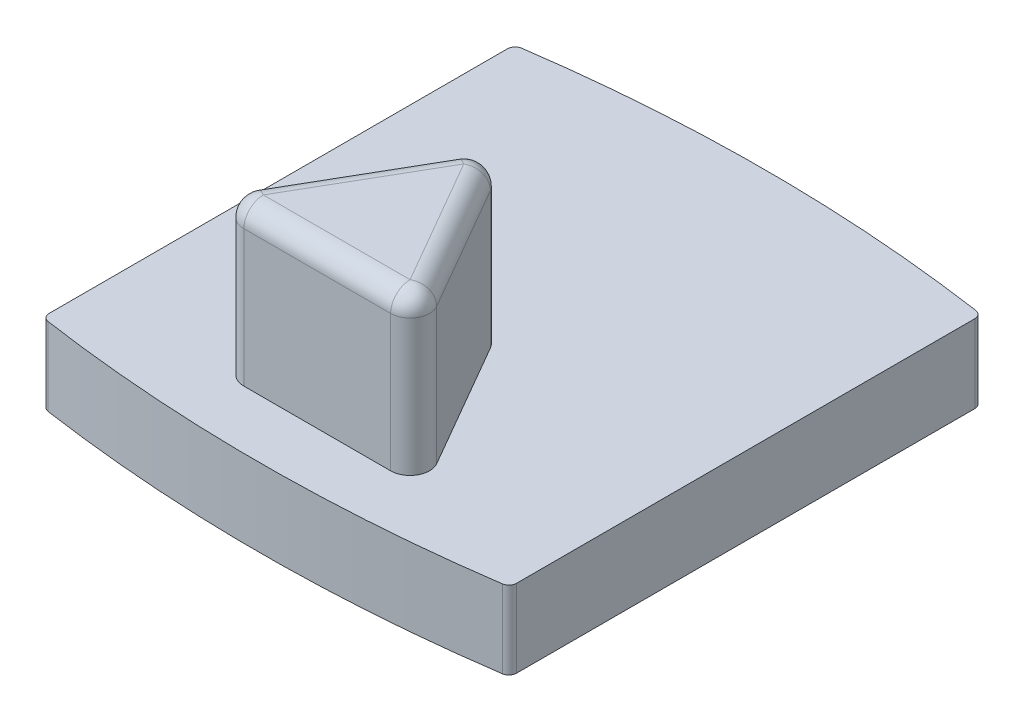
from build123d import *

# Parameters (mm, degrees)
SKETCH1_W           = 12
SKETCH1_H           = 13
BOSS_EXTRUDE1_DEPTH = 2
CUT_EXTRUDE8_DEPTH  = 10
BOSS_EXTRUDE2_DEPTH = 4
FILLET1_R           = 0.5
FILLET2_R           = 0.5
FILLET3_R           = 0.2


with BuildPart() as part:
    # Sketch1 → Boss-Extrude1 (new body)
    with BuildSketch(Plane(origin=(0, 0, 0), x_dir=(1, 0, 0), z_dir=(0, 1, 0))):
        Rectangle(SKETCH1_W, SKETCH1_H)
    extrude(amount=BOSS_EXTRUDE1_DEPTH)

    # Sketch3 → Cut-Extrude8 (cut)
    with BuildSketch(Plane(origin=(0, 2, 0), x_dir=(1, 0, 0), z_dir=(0, 1, 0))):
        with BuildLine():
            Line((0, -11), (0, -6.5))
            Line((0, -6.5), (-6, -6.5))
            Line((-6, -6.5), (-6, -6.053089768))
            ThreePointArc((-6, -6.053089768), (-14.326182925, -3.881532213), (-22.005681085, 0))
            ThreePointArc((-22.005681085, 0), (-23.973466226, -1.357651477), (-25.857716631, -2.829044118))
            ThreePointArc((-25.857716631, -2.829044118), (-13.559000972, -8.90866454), (0, -11))
        make_face()
        with BuildLine():
            Line((6, -6.5), (0, -6.5))
            Line((0, -6.5), (0, -11))
            ThreePointArc((0, -11), (13.559000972, -8.90866454), (25.857716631, -2.829044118))
            ThreePointArc((25.857716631, -2.829044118), (23.973466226, -1.357651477), (22.005681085, 0))
            ThreePointArc((22.005681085, 0), (14.326182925, -3.881532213), (6, -6.053089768))
            Line((6, -6.053089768), (6, -6.5))
        make_face()
        with BuildLine():
            Line((-6, 6.5), (0, 6.5))
            Line((0, 6.5), (6, 6.5))
            Line((6, 6.5), (6, 6.053089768))
            ThreePointArc((6, 6.053089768), (14.326182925, 3.881532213), (22.005681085, 0))
            ThreePointArc((22.005681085, 0), (23.973466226, 1.357651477), (25.857716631, 2.829044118))
            ThreePointArc((25.857716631, 2.829044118), (0, 11), (-25.857716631, 2.829044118))
            ThreePointArc((-25.857716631, 2.829044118), (-23.973466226, 1.357651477), (-22.005681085, 0))
            ThreePointArc((-22.005681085, 0), (-14.326182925, 3.881532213), (-6, 6.053089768))
            Line((-6, 6.053089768), (-6, 6.5))
        make_face()
        with BuildLine():
            ThreePointArc((-6, 6.053089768), (-3.008310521, 6.388117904), (0, 6.5))
            Line((0, 6.5), (-6, 6.5))
            Line((-6, 6.5), (-6, 6.053089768))
        make_face()
        with BuildLine():
            Line((6, 6.5), (0, 6.5))
            ThreePointArc((0, 6.5), (3.008310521, 6.388117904), (6, 6.053089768))
            Line((6, 6.053089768), (6, 6.5))
        make_face()
        with BuildLine():
            ThreePointArc((6, -6.053089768), (3.008310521, -6.388117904), (0, -6.5))
            Line((0, -6.5), (6, -6.5))
            Line((6, -6.5), (6, -6.053089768))
        make_face()
        with BuildLine():
            Line((-6, -6.5), (0, -6.5))
            ThreePointArc((0, -6.5), (-3.008310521, -6.388117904), (-6, -6.053089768))
            Line((-6, -6.053089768), (-6, -6.5))
        make_face()
    extrude(amount=-CUT_EXTRUDE8_DEPTH, mode=Mode.SUBTRACT)

    # Sketch6 → Boss-Extrude2 (add)
    with BuildSketch(Plane(origin=(0, 2, 0), x_dir=(1, 0, 0), z_dir=(0, 1, 0))):
        Polygon((-2.75, -5), (2.75, -5), (0, -0.236860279), align=None)
    extrude(amount=BOSS_EXTRUDE2_DEPTH)

    # Fillet1
    fillet1_edges = [part.edges().sort_by_distance(p)[0] for p in [
        (0, 4, 0.236860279),
        (-2.75, 4, 5),
        (2.75, 4, 5),
    ]]
    fillet(fillet1_edges, radius=FILLET1_R)

    # Fillet2
    fillet2_edges = [part.edges().sort_by_distance(p)[0] for p in [
        (-1.375, 6, 2.61843014),
        (1.375, 6, 2.61843014),
        (0, 6, 5),
        (2.316987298, 6, 4.75),
        (-2.316987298, 6, 4.75),
        (0, 6, 0.736860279),
    ]]
    fillet(fillet2_edges, radius=FILLET2_R)

    # Fillet3
    fillet3_edges = [part.edges().sort_by_distance(p)[0] for p in [
        (6, 1, -6.053089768),
        (-6, 1, -6.053089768),
        (-6, 1, 6.053089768),
        (6, 1, 6.053089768),
    ]]
    fillet(fillet3_edges, radius=FILLET3_R)


solid = part.part
